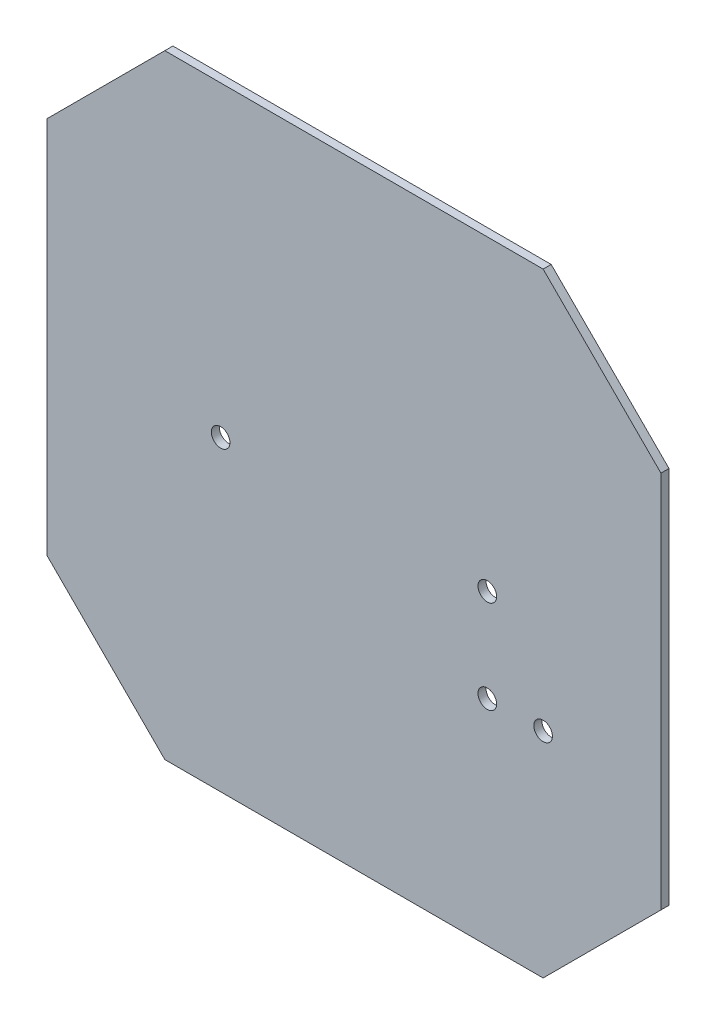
ISO-10303-21;
HEADER;
FILE_DESCRIPTION(('STEP AP214'),'2;1');
FILE_NAME('part.step','',(''),(''),'','','');
FILE_SCHEMA(('AUTOMOTIVE_DESIGN { 1 0 10303 214 1 1 1 1 }'));
ENDSEC;
DATA;
#1=APPLICATION_CONTEXT('core data for automotive mechanical design processes');
#2=APPLICATION_PROTOCOL_DEFINITION('international standard','automotive_design',2000,#1);
#3=PRODUCT_CONTEXT('',#1,'mechanical');
#4=PRODUCT('Part','Part','',(#3));
#5=PRODUCT_RELATED_PRODUCT_CATEGORY('part','',(#4));
#6=PRODUCT_DEFINITION_FORMATION('','',#4);
#7=PRODUCT_DEFINITION_CONTEXT('part definition',#1,'design');
#8=PRODUCT_DEFINITION('design','',#6,#7);
#9=PRODUCT_DEFINITION_SHAPE('','',#8);
#10=(LENGTH_UNIT() NAMED_UNIT(*) SI_UNIT(.MILLI.,.METRE.));
#11=(NAMED_UNIT(*) PLANE_ANGLE_UNIT() SI_UNIT($,.RADIAN.));
#12=(NAMED_UNIT(*) SI_UNIT($,.STERADIAN.) SOLID_ANGLE_UNIT());
#13=UNCERTAINTY_MEASURE_WITH_UNIT(LENGTH_MEASURE(1.E-05),#10,'distance_accuracy_value','');
#14=(GEOMETRIC_REPRESENTATION_CONTEXT(3) GLOBAL_UNCERTAINTY_ASSIGNED_CONTEXT((#13)) GLOBAL_UNIT_ASSIGNED_CONTEXT((#10,
#11,#12)) REPRESENTATION_CONTEXT('',''));
#15=CARTESIAN_POINT('',(0.,0.,0.));
#16=DIRECTION('',(0.,0.,1.));
#17=DIRECTION('',(1.,0.,0.));
#18=AXIS2_PLACEMENT_3D('',#15,#16,#17);
#19=CARTESIAN_POINT('',(0.,0.,1.3));
#20=DIRECTION('',(0.,0.,1.));
#21=DIRECTION('',(1.,0.,0.));
#22=AXIS2_PLACEMENT_3D('',#19,#20,#21);
#23=PLANE('',#22);
#24=CARTESIAN_POINT('',(41.3510320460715,16.5347355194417,1.3));
#25=DIRECTION('',(0.,0.,1.));
#26=DIRECTION('',(1.,0.,0.));
#27=AXIS2_PLACEMENT_3D('',#24,#25,#26);
#28=CIRCLE('',#27,1.5);
#29=CARTESIAN_POINT('',(42.8510320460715,16.5347355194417,1.3));
#30=VERTEX_POINT('',#29);
#31=EDGE_CURVE('E187',#30,#30,#28,.T.);
#32=ORIENTED_EDGE('',*,*,#31,.F.);
#33=EDGE_LOOP('',(#32));
#34=FACE_BOUND('',#33,.T.);
#35=CARTESIAN_POINT('',(-1.64896795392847,31.5347355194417,1.3));
#36=DIRECTION('',(0.,0.,1.));
#37=DIRECTION('',(1.,0.,0.));
#38=AXIS2_PLACEMENT_3D('',#35,#36,#37);
#39=CIRCLE('',#38,1.5);
#40=CARTESIAN_POINT('',(-0.148967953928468,31.5347355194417,1.3));
#41=VERTEX_POINT('',#40);
#42=EDGE_CURVE('E133',#41,#41,#39,.T.);
#43=ORIENTED_EDGE('',*,*,#42,.F.);
#44=EDGE_LOOP('',(#43));
#45=FACE_BOUND('',#44,.T.);
#46=DIRECTION('',(-1.,0.,0.));
#47=VECTOR('',#46,1.);
#48=CARTESIAN_POINT('',(50.3510320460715,81.0347355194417,1.3));
#49=LINE('',#48,#47);
#50=CARTESIAN_POINT('',(50.3510320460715,81.0347355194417,1.3));
#51=VERTEX_POINT('',#50);
#52=CARTESIAN_POINT('',(-10.6489679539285,81.0347355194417,1.3));
#53=VERTEX_POINT('',#52);
#54=EDGE_CURVE('E144',#51,#53,#49,.T.);
#55=ORIENTED_EDGE('',*,*,#54,.T.);
#56=DIRECTION('',(-0.707106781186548,-0.707106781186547,0.));
#57=VECTOR('',#56,1.);
#58=CARTESIAN_POINT('',(-10.6489679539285,81.0347355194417,1.3));
#59=LINE('',#58,#57);
#60=CARTESIAN_POINT('',(-29.6489679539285,62.0347355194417,1.3));
#61=VERTEX_POINT('',#60);
#62=EDGE_CURVE('E92',#53,#61,#59,.T.);
#63=ORIENTED_EDGE('',*,*,#62,.T.);
#64=DIRECTION('',(0.,-1.,0.));
#65=VECTOR('',#64,1.);
#66=CARTESIAN_POINT('',(-29.6489679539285,62.0347355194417,1.3));
#67=LINE('',#66,#65);
#68=CARTESIAN_POINT('',(-29.6489679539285,1.03473551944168,1.3));
#69=VERTEX_POINT('',#68);
#70=EDGE_CURVE('E159',#61,#69,#67,.T.);
#71=ORIENTED_EDGE('',*,*,#70,.T.);
#72=DIRECTION('',(0.707106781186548,-0.707106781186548,0.));
#73=VECTOR('',#72,1.);
#74=CARTESIAN_POINT('',(-29.6489679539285,1.03473551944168,1.3));
#75=LINE('',#74,#73);
#76=CARTESIAN_POINT('',(-10.6489679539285,-17.9652644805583,1.3));
#77=VERTEX_POINT('',#76);
#78=EDGE_CURVE('E172',#69,#77,#75,.T.);
#79=ORIENTED_EDGE('',*,*,#78,.T.);
#80=DIRECTION('',(1.,0.,0.));
#81=VECTOR('',#80,1.);
#82=CARTESIAN_POINT('',(-10.6489679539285,-17.9652644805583,1.3));
#83=LINE('',#82,#81);
#84=CARTESIAN_POINT('',(50.3510320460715,-17.9652644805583,1.3));
#85=VERTEX_POINT('',#84);
#86=EDGE_CURVE('E111',#77,#85,#83,.T.);
#87=ORIENTED_EDGE('',*,*,#86,.T.);
#88=DIRECTION('',(0.707106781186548,0.707106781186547,0.));
#89=VECTOR('',#88,1.);
#90=CARTESIAN_POINT('',(50.3510320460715,-17.9652644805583,1.3));
#91=LINE('',#90,#89);
#92=CARTESIAN_POINT('',(69.3510320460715,1.03473551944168,1.3));
#93=VERTEX_POINT('',#92);
#94=EDGE_CURVE('E105',#85,#93,#91,.T.);
#95=ORIENTED_EDGE('',*,*,#94,.T.);
#96=DIRECTION('',(0.,1.,0.));
#97=VECTOR('',#96,1.);
#98=CARTESIAN_POINT('',(69.3510320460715,1.03473551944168,1.3));
#99=LINE('',#98,#97);
#100=CARTESIAN_POINT('',(69.3510320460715,62.0347355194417,1.3));
#101=VERTEX_POINT('',#100);
#102=EDGE_CURVE('E109',#93,#101,#99,.T.);
#103=ORIENTED_EDGE('',*,*,#102,.T.);
#104=DIRECTION('',(-0.707106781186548,0.707106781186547,0.));
#105=VECTOR('',#104,1.);
#106=CARTESIAN_POINT('',(69.3510320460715,62.0347355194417,1.3));
#107=LINE('',#106,#105);
#108=EDGE_CURVE('E49',#101,#51,#107,.T.);
#109=ORIENTED_EDGE('',*,*,#108,.T.);
#110=EDGE_LOOP('',(#55,#63,#71,#79,#87,#95,#103,#109));
#111=FACE_BOUND('',#110,.T.);
#112=CARTESIAN_POINT('',(41.3510320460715,31.5347355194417,1.3));
#113=DIRECTION('',(0.,0.,1.));
#114=DIRECTION('',(1.,0.,0.));
#115=AXIS2_PLACEMENT_3D('',#112,#113,#114);
#116=CIRCLE('',#115,1.5);
#117=CARTESIAN_POINT('',(42.8510320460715,31.5347355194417,1.3));
#118=VERTEX_POINT('',#117);
#119=EDGE_CURVE('E181',#118,#118,#116,.T.);
#120=ORIENTED_EDGE('',*,*,#119,.F.);
#121=EDGE_LOOP('',(#120));
#122=FACE_BOUND('',#121,.T.);
#123=CARTESIAN_POINT('',(50.3510320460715,16.5347355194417,1.3));
#124=DIRECTION('',(0.,0.,1.));
#125=DIRECTION('',(1.,0.,0.));
#126=AXIS2_PLACEMENT_3D('',#123,#124,#125);
#127=CIRCLE('',#126,1.5);
#128=CARTESIAN_POINT('',(51.8510320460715,16.5347355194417,1.3));
#129=VERTEX_POINT('',#128);
#130=EDGE_CURVE('E193',#129,#129,#127,.T.);
#131=ORIENTED_EDGE('',*,*,#130,.F.);
#132=EDGE_LOOP('',(#131));
#133=FACE_BOUND('',#132,.T.);
#134=ADVANCED_FACE('F32',(#34,#45,#111,#122,#133),#23,.T.);
#135=CARTESIAN_POINT('',(0.,0.,0.));
#136=DIRECTION('',(0.,0.,1.));
#137=DIRECTION('',(1.,0.,0.));
#138=AXIS2_PLACEMENT_3D('',#135,#136,#137);
#139=PLANE('',#138);
#140=CARTESIAN_POINT('',(41.3510320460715,16.5347355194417,0.));
#141=DIRECTION('',(0.,0.,1.));
#142=DIRECTION('',(1.,0.,0.));
#143=AXIS2_PLACEMENT_3D('',#140,#141,#142);
#144=CIRCLE('',#143,1.5);
#145=CARTESIAN_POINT('',(42.8510320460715,16.5347355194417,0.));
#146=VERTEX_POINT('',#145);
#147=EDGE_CURVE('E190',#146,#146,#144,.T.);
#148=ORIENTED_EDGE('',*,*,#147,.T.);
#149=EDGE_LOOP('',(#148));
#150=FACE_BOUND('',#149,.T.);
#151=CARTESIAN_POINT('',(-1.64896795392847,31.5347355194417,0.));
#152=DIRECTION('',(0.,0.,1.));
#153=DIRECTION('',(1.,0.,0.));
#154=AXIS2_PLACEMENT_3D('',#151,#152,#153);
#155=CIRCLE('',#154,1.5);
#156=CARTESIAN_POINT('',(-0.148967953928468,31.5347355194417,0.));
#157=VERTEX_POINT('',#156);
#158=EDGE_CURVE('E178',#157,#157,#155,.T.);
#159=ORIENTED_EDGE('',*,*,#158,.T.);
#160=EDGE_LOOP('',(#159));
#161=FACE_BOUND('',#160,.T.);
#162=DIRECTION('',(-1.,0.,0.));
#163=VECTOR('',#162,1.);
#164=CARTESIAN_POINT('',(50.3510320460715,81.0347355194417,0.));
#165=LINE('',#164,#163);
#166=CARTESIAN_POINT('',(50.3510320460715,81.0347355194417,0.));
#167=VERTEX_POINT('',#166);
#168=CARTESIAN_POINT('',(-10.6489679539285,81.0347355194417,0.));
#169=VERTEX_POINT('',#168);
#170=EDGE_CURVE('E129',#167,#169,#165,.T.);
#171=ORIENTED_EDGE('',*,*,#170,.F.);
#172=DIRECTION('',(-0.707106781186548,0.707106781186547,0.));
#173=VECTOR('',#172,1.);
#174=CARTESIAN_POINT('',(69.3510320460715,62.0347355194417,0.));
#175=LINE('',#174,#173);
#176=CARTESIAN_POINT('',(69.3510320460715,62.0347355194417,0.));
#177=VERTEX_POINT('',#176);
#178=EDGE_CURVE('E84',#177,#167,#175,.T.);
#179=ORIENTED_EDGE('',*,*,#178,.F.);
#180=DIRECTION('',(0.,1.,0.));
#181=VECTOR('',#180,1.);
#182=CARTESIAN_POINT('',(69.3510320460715,1.03473551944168,0.));
#183=LINE('',#182,#181);
#184=CARTESIAN_POINT('',(69.3510320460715,1.03473551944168,0.));
#185=VERTEX_POINT('',#184);
#186=EDGE_CURVE('E78',#185,#177,#183,.T.);
#187=ORIENTED_EDGE('',*,*,#186,.F.);
#188=DIRECTION('',(0.707106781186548,0.707106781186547,0.));
#189=VECTOR('',#188,1.);
#190=CARTESIAN_POINT('',(50.3510320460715,-17.9652644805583,0.));
#191=LINE('',#190,#189);
#192=CARTESIAN_POINT('',(50.3510320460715,-17.9652644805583,0.));
#193=VERTEX_POINT('',#192);
#194=EDGE_CURVE('E119',#193,#185,#191,.T.);
#195=ORIENTED_EDGE('',*,*,#194,.F.);
#196=DIRECTION('',(1.,0.,0.));
#197=VECTOR('',#196,1.);
#198=CARTESIAN_POINT('',(-10.6489679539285,-17.9652644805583,0.));
#199=LINE('',#198,#197);
#200=CARTESIAN_POINT('',(-10.6489679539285,-17.9652644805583,0.));
#201=VERTEX_POINT('',#200);
#202=EDGE_CURVE('E139',#201,#193,#199,.T.);
#203=ORIENTED_EDGE('',*,*,#202,.F.);
#204=DIRECTION('',(0.707106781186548,-0.707106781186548,0.));
#205=VECTOR('',#204,1.);
#206=CARTESIAN_POINT('',(-29.6489679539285,1.03473551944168,0.));
#207=LINE('',#206,#205);
#208=CARTESIAN_POINT('',(-29.6489679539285,1.03473551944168,0.));
#209=VERTEX_POINT('',#208);
#210=EDGE_CURVE('E137',#209,#201,#207,.T.);
#211=ORIENTED_EDGE('',*,*,#210,.F.);
#212=DIRECTION('',(0.,-1.,0.));
#213=VECTOR('',#212,1.);
#214=CARTESIAN_POINT('',(-29.6489679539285,62.0347355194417,0.));
#215=LINE('',#214,#213);
#216=CARTESIAN_POINT('',(-29.6489679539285,62.0347355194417,0.));
#217=VERTEX_POINT('',#216);
#218=EDGE_CURVE('E135',#217,#209,#215,.T.);
#219=ORIENTED_EDGE('',*,*,#218,.F.);
#220=DIRECTION('',(-0.707106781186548,-0.707106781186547,0.));
#221=VECTOR('',#220,1.);
#222=CARTESIAN_POINT('',(-10.6489679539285,81.0347355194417,0.));
#223=LINE('',#222,#221);
#224=EDGE_CURVE('E132',#169,#217,#223,.T.);
#225=ORIENTED_EDGE('',*,*,#224,.F.);
#226=EDGE_LOOP('',(#171,#179,#187,#195,#203,#211,#219,#225));
#227=FACE_BOUND('',#226,.T.);
#228=CARTESIAN_POINT('',(41.3510320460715,31.5347355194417,0.));
#229=DIRECTION('',(0.,0.,1.));
#230=DIRECTION('',(1.,0.,0.));
#231=AXIS2_PLACEMENT_3D('',#228,#229,#230);
#232=CIRCLE('',#231,1.5);
#233=CARTESIAN_POINT('',(42.8510320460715,31.5347355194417,0.));
#234=VERTEX_POINT('',#233);
#235=EDGE_CURVE('E184',#234,#234,#232,.T.);
#236=ORIENTED_EDGE('',*,*,#235,.T.);
#237=EDGE_LOOP('',(#236));
#238=FACE_BOUND('',#237,.T.);
#239=CARTESIAN_POINT('',(50.3510320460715,16.5347355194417,0.));
#240=DIRECTION('',(0.,0.,1.));
#241=DIRECTION('',(1.,0.,0.));
#242=AXIS2_PLACEMENT_3D('',#239,#240,#241);
#243=CIRCLE('',#242,1.5);
#244=CARTESIAN_POINT('',(51.8510320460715,16.5347355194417,0.));
#245=VERTEX_POINT('',#244);
#246=EDGE_CURVE('E196',#245,#245,#243,.T.);
#247=ORIENTED_EDGE('',*,*,#246,.T.);
#248=EDGE_LOOP('',(#247));
#249=FACE_BOUND('',#248,.T.);
#250=ADVANCED_FACE('F163',(#150,#161,#227,#238,#249),#139,.F.);
#251=CARTESIAN_POINT('',(50.3510320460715,81.0347355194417,1.3));
#252=DIRECTION('',(0.,-1.,0.));
#253=DIRECTION('',(0.,0.,-1.));
#254=AXIS2_PLACEMENT_3D('',#251,#252,#253);
#255=PLANE('',#254);
#256=ORIENTED_EDGE('',*,*,#170,.T.);
#257=DIRECTION('',(0.,0.,-1.));
#258=VECTOR('',#257,1.);
#259=CARTESIAN_POINT('',(-10.6489679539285,81.0347355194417,1.3));
#260=LINE('',#259,#258);
#261=EDGE_CURVE('E11',#53,#169,#260,.T.);
#262=ORIENTED_EDGE('',*,*,#261,.F.);
#263=ORIENTED_EDGE('',*,*,#54,.F.);
#264=DIRECTION('',(0.,0.,-1.));
#265=VECTOR('',#264,1.);
#266=CARTESIAN_POINT('',(50.3510320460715,81.0347355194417,1.3));
#267=LINE('',#266,#265);
#268=EDGE_CURVE('E125',#51,#167,#267,.T.);
#269=ORIENTED_EDGE('',*,*,#268,.T.);
#270=EDGE_LOOP('',(#256,#262,#263,#269));
#271=FACE_BOUND('',#270,.T.);
#272=ADVANCED_FACE('F34',(#271),#255,.F.);
#273=CARTESIAN_POINT('',(-10.6489679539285,81.0347355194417,1.3));
#274=DIRECTION('',(0.707106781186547,-0.707106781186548,0.));
#275=DIRECTION('',(0.707106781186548,0.707106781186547,0.));
#276=AXIS2_PLACEMENT_3D('',#273,#274,#275);
#277=PLANE('',#276);
#278=ORIENTED_EDGE('',*,*,#224,.T.);
#279=DIRECTION('',(0.,0.,-1.));
#280=VECTOR('',#279,1.);
#281=CARTESIAN_POINT('',(-29.6489679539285,62.0347355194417,1.3));
#282=LINE('',#281,#280);
#283=EDGE_CURVE('E41',#61,#217,#282,.T.);
#284=ORIENTED_EDGE('',*,*,#283,.F.);
#285=ORIENTED_EDGE('',*,*,#62,.F.);
#286=ORIENTED_EDGE('',*,*,#261,.T.);
#287=EDGE_LOOP('',(#278,#284,#285,#286));
#288=FACE_BOUND('',#287,.T.);
#289=ADVANCED_FACE('F231',(#288),#277,.F.);
#290=CARTESIAN_POINT('',(-29.6489679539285,62.0347355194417,1.3));
#291=DIRECTION('',(1.,0.,0.));
#292=DIRECTION('',(0.,1.,0.));
#293=AXIS2_PLACEMENT_3D('',#290,#291,#292);
#294=PLANE('',#293);
#295=ORIENTED_EDGE('',*,*,#218,.T.);
#296=DIRECTION('',(0.,0.,-1.));
#297=VECTOR('',#296,1.);
#298=CARTESIAN_POINT('',(-29.6489679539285,1.03473551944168,1.3));
#299=LINE('',#298,#297);
#300=EDGE_CURVE('E151',#69,#209,#299,.T.);
#301=ORIENTED_EDGE('',*,*,#300,.F.);
#302=ORIENTED_EDGE('',*,*,#70,.F.);
#303=ORIENTED_EDGE('',*,*,#283,.T.);
#304=EDGE_LOOP('',(#295,#301,#302,#303));
#305=FACE_BOUND('',#304,.T.);
#306=ADVANCED_FACE('F157',(#305),#294,.F.);
#307=CARTESIAN_POINT('',(-29.6489679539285,1.03473551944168,1.3));
#308=DIRECTION('',(0.707106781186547,0.707106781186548,0.));
#309=DIRECTION('',(-0.707106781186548,0.707106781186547,0.));
#310=AXIS2_PLACEMENT_3D('',#307,#308,#309);
#311=PLANE('',#310);
#312=ORIENTED_EDGE('',*,*,#210,.T.);
#313=DIRECTION('',(0.,0.,-1.));
#314=VECTOR('',#313,1.);
#315=CARTESIAN_POINT('',(-10.6489679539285,-17.9652644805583,1.3));
#316=LINE('',#315,#314);
#317=EDGE_CURVE('E148',#77,#201,#316,.T.);
#318=ORIENTED_EDGE('',*,*,#317,.F.);
#319=ORIENTED_EDGE('',*,*,#78,.F.);
#320=ORIENTED_EDGE('',*,*,#300,.T.);
#321=EDGE_LOOP('',(#312,#318,#319,#320));
#322=FACE_BOUND('',#321,.T.);
#323=ADVANCED_FACE('F168',(#322),#311,.F.);
#324=CARTESIAN_POINT('',(-10.6489679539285,-17.9652644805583,1.3));
#325=DIRECTION('',(0.,1.,0.));
#326=DIRECTION('',(0.,0.,1.));
#327=AXIS2_PLACEMENT_3D('',#324,#325,#326);
#328=PLANE('',#327);
#329=ORIENTED_EDGE('',*,*,#202,.T.);
#330=DIRECTION('',(0.,0.,-1.));
#331=VECTOR('',#330,1.);
#332=CARTESIAN_POINT('',(50.3510320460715,-17.9652644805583,1.3));
#333=LINE('',#332,#331);
#334=EDGE_CURVE('E120',#85,#193,#333,.T.);
#335=ORIENTED_EDGE('',*,*,#334,.F.);
#336=ORIENTED_EDGE('',*,*,#86,.F.);
#337=ORIENTED_EDGE('',*,*,#317,.T.);
#338=EDGE_LOOP('',(#329,#335,#336,#337));
#339=FACE_BOUND('',#338,.T.);
#340=ADVANCED_FACE('F171',(#339),#328,.F.);
#341=CARTESIAN_POINT('',(50.3510320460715,-17.9652644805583,1.3));
#342=DIRECTION('',(-0.707106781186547,0.707106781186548,0.));
#343=DIRECTION('',(-0.707106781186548,-0.707106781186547,0.));
#344=AXIS2_PLACEMENT_3D('',#341,#342,#343);
#345=PLANE('',#344);
#346=ORIENTED_EDGE('',*,*,#194,.T.);
#347=DIRECTION('',(0.,0.,-1.));
#348=VECTOR('',#347,1.);
#349=CARTESIAN_POINT('',(69.3510320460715,1.03473551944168,1.3));
#350=LINE('',#349,#348);
#351=EDGE_CURVE('E116',#93,#185,#350,.T.);
#352=ORIENTED_EDGE('',*,*,#351,.F.);
#353=ORIENTED_EDGE('',*,*,#94,.F.);
#354=ORIENTED_EDGE('',*,*,#334,.T.);
#355=EDGE_LOOP('',(#346,#352,#353,#354));
#356=FACE_BOUND('',#355,.T.);
#357=ADVANCED_FACE('F117',(#356),#345,.F.);
#358=CARTESIAN_POINT('',(69.3510320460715,1.03473551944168,1.3));
#359=DIRECTION('',(-1.,0.,0.));
#360=DIRECTION('',(0.,-1.,0.));
#361=AXIS2_PLACEMENT_3D('',#358,#359,#360);
#362=PLANE('',#361);
#363=ORIENTED_EDGE('',*,*,#186,.T.);
#364=DIRECTION('',(0.,0.,-1.));
#365=VECTOR('',#364,1.);
#366=CARTESIAN_POINT('',(69.3510320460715,62.0347355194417,1.3));
#367=LINE('',#366,#365);
#368=EDGE_CURVE('E121',#101,#177,#367,.T.);
#369=ORIENTED_EDGE('',*,*,#368,.F.);
#370=ORIENTED_EDGE('',*,*,#102,.F.);
#371=ORIENTED_EDGE('',*,*,#351,.T.);
#372=EDGE_LOOP('',(#363,#369,#370,#371));
#373=FACE_BOUND('',#372,.T.);
#374=ADVANCED_FACE('F123',(#373),#362,.F.);
#375=CARTESIAN_POINT('',(69.3510320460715,62.0347355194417,1.3));
#376=DIRECTION('',(-0.707106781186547,-0.707106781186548,0.));
#377=DIRECTION('',(0.707106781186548,-0.707106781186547,0.));
#378=AXIS2_PLACEMENT_3D('',#375,#376,#377);
#379=PLANE('',#378);
#380=ORIENTED_EDGE('',*,*,#178,.T.);
#381=ORIENTED_EDGE('',*,*,#268,.F.);
#382=ORIENTED_EDGE('',*,*,#108,.F.);
#383=ORIENTED_EDGE('',*,*,#368,.T.);
#384=EDGE_LOOP('',(#380,#381,#382,#383));
#385=FACE_BOUND('',#384,.T.);
#386=ADVANCED_FACE('F219',(#385),#379,.F.);
#387=CARTESIAN_POINT('',(-1.64896795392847,31.5347355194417,1.3));
#388=DIRECTION('',(0.,0.,-1.));
#389=DIRECTION('',(-1.,0.,0.));
#390=AXIS2_PLACEMENT_3D('',#387,#388,#389);
#391=CYLINDRICAL_SURFACE('',#390,1.5);
#392=ORIENTED_EDGE('',*,*,#42,.T.);
#393=EDGE_LOOP('',(#392));
#394=FACE_BOUND('',#393,.T.);
#395=ORIENTED_EDGE('',*,*,#158,.F.);
#396=EDGE_LOOP('',(#395));
#397=FACE_BOUND('',#396,.T.);
#398=ADVANCED_FACE('F216',(#394,#397),#391,.F.);
#399=CARTESIAN_POINT('',(41.3510320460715,31.5347355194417,1.3));
#400=DIRECTION('',(0.,0.,-1.));
#401=DIRECTION('',(-1.,0.,0.));
#402=AXIS2_PLACEMENT_3D('',#399,#400,#401);
#403=CYLINDRICAL_SURFACE('',#402,1.5);
#404=ORIENTED_EDGE('',*,*,#119,.T.);
#405=EDGE_LOOP('',(#404));
#406=FACE_BOUND('',#405,.T.);
#407=ORIENTED_EDGE('',*,*,#235,.F.);
#408=EDGE_LOOP('',(#407));
#409=FACE_BOUND('',#408,.T.);
#410=ADVANCED_FACE('F295',(#406,#409),#403,.F.);
#411=CARTESIAN_POINT('',(41.3510320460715,16.5347355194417,1.3));
#412=DIRECTION('',(0.,0.,-1.));
#413=DIRECTION('',(-1.,0.,0.));
#414=AXIS2_PLACEMENT_3D('',#411,#412,#413);
#415=CYLINDRICAL_SURFACE('',#414,1.5);
#416=ORIENTED_EDGE('',*,*,#31,.T.);
#417=EDGE_LOOP('',(#416));
#418=FACE_BOUND('',#417,.T.);
#419=ORIENTED_EDGE('',*,*,#147,.F.);
#420=EDGE_LOOP('',(#419));
#421=FACE_BOUND('',#420,.T.);
#422=ADVANCED_FACE('F303',(#418,#421),#415,.F.);
#423=CARTESIAN_POINT('',(50.3510320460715,16.5347355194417,1.3));
#424=DIRECTION('',(0.,0.,-1.));
#425=DIRECTION('',(-1.,0.,0.));
#426=AXIS2_PLACEMENT_3D('',#423,#424,#425);
#427=CYLINDRICAL_SURFACE('',#426,1.5);
#428=ORIENTED_EDGE('',*,*,#130,.T.);
#429=EDGE_LOOP('',(#428));
#430=FACE_BOUND('',#429,.T.);
#431=ORIENTED_EDGE('',*,*,#246,.F.);
#432=EDGE_LOOP('',(#431));
#433=FACE_BOUND('',#432,.T.);
#434=ADVANCED_FACE('F202',(#430,#433),#427,.F.);
#435=CLOSED_SHELL('',(#134,#250,#272,#289,#306,#323,#340,#357,#374,#386,#398,#410,#422,#434));
#436=MANIFOLD_SOLID_BREP('B2',#435);
#437=ADVANCED_BREP_SHAPE_REPRESENTATION('',(#18,#436),#14);
#438=SHAPE_DEFINITION_REPRESENTATION(#9,#437);
ENDSEC;
END-ISO-10303-21;
